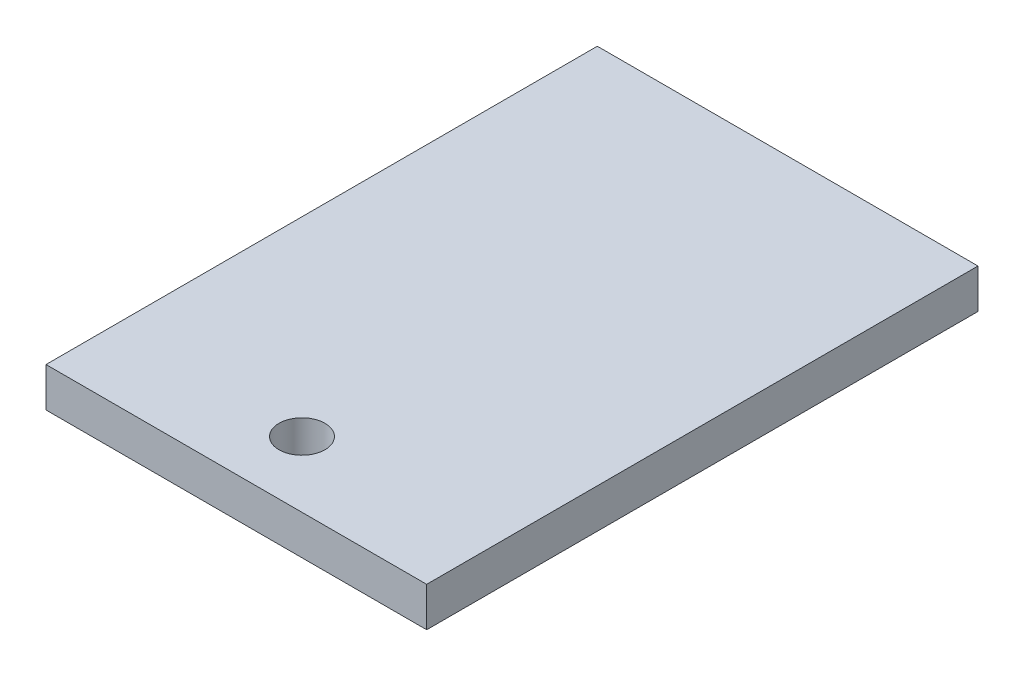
from build123d import *

# Parameters (mm, degrees)
SKETCH1_W      = 29
SKETCH1_H      = 42
SKETCH1_R      = 1.75
EXTRUDE1_DEPTH = 3


with BuildPart() as part:
    # Sketch1 → Extrude1 (new body)
    with BuildSketch(Plane(origin=(0, 0, 0), x_dir=(1, 0, 0), z_dir=(0, 1, 0))):
        with Locations((14.5, 21)):
            Rectangle(SKETCH1_W, SKETCH1_H)
        with Locations(Location((14.5, 5, 0), (0, 0, 270))):
            Circle(SKETCH1_R, mode=Mode.SUBTRACT)
    extrude(amount=EXTRUDE1_DEPTH)


solid = part.part
